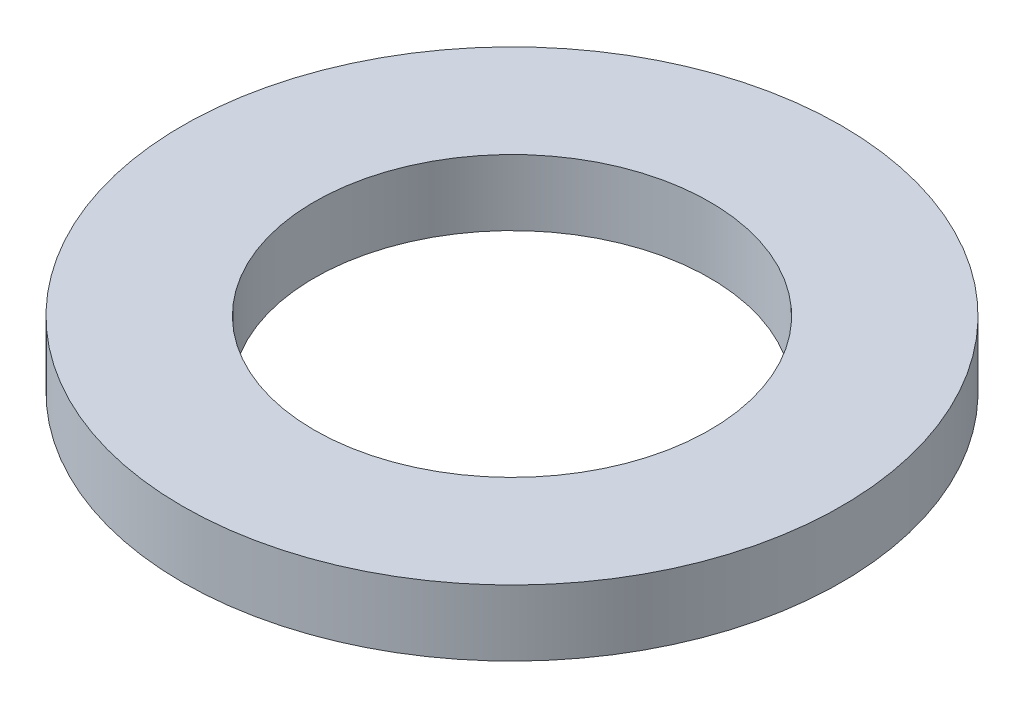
from build123d import *

# Parameters (mm, degrees)
ESQUISSE1_R      = 40
ESQUISSE1_R_2    = 24
EXTRUSION1_DEPTH = 8


with BuildPart() as part:
    # Esquisse1 → Extrusion1 (new body)
    with BuildSketch(Plane(origin=(0, 0, 0), x_dir=(1, 0, 0), z_dir=(0, 1, 0))):
        with Locations(Location((0, 0, 0), (0, 0, 270))):
            Circle(ESQUISSE1_R)
        with Locations(Location((0, 0, 0), (0, 0, 270))):
            Circle(ESQUISSE1_R_2, mode=Mode.SUBTRACT)
    extrude(amount=EXTRUSION1_DEPTH)


solid = part.part
